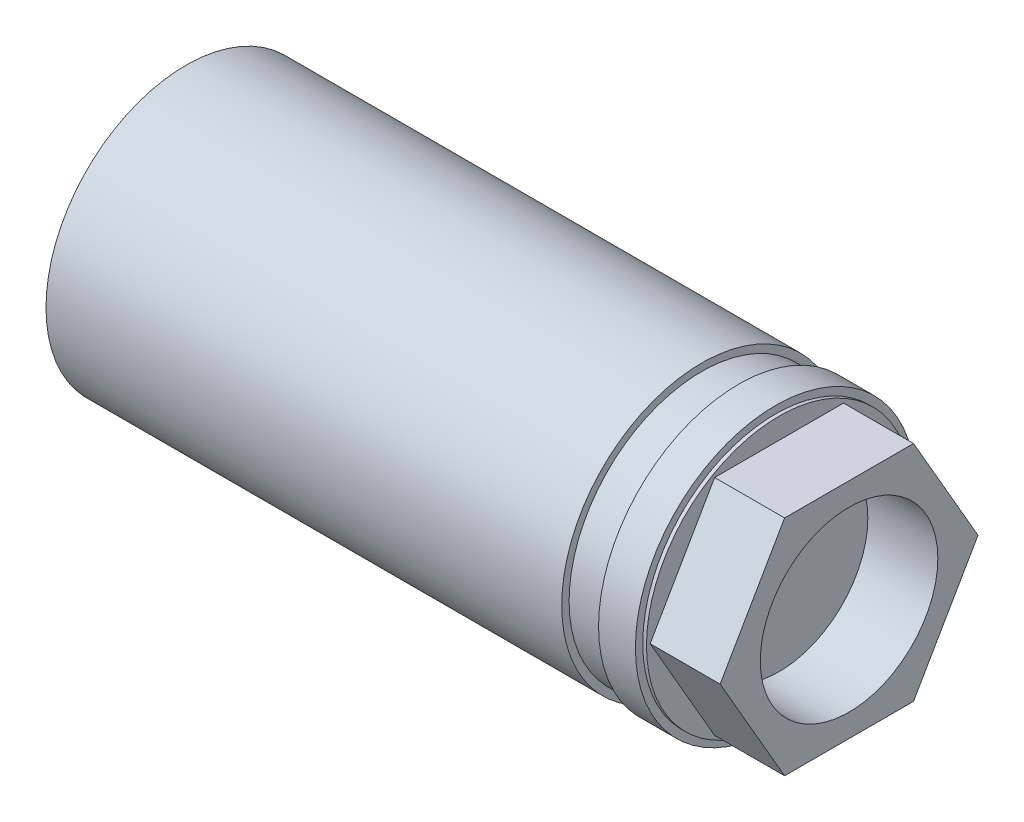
ISO-10303-21;
HEADER;
FILE_DESCRIPTION(('STEP AP214'),'2;1');
FILE_NAME('part.step','',(''),(''),'','','');
FILE_SCHEMA(('AUTOMOTIVE_DESIGN { 1 0 10303 214 1 1 1 1 }'));
ENDSEC;
DATA;
#1=APPLICATION_CONTEXT('core data for automotive mechanical design processes');
#2=APPLICATION_PROTOCOL_DEFINITION('international standard','automotive_design',2000,#1);
#3=PRODUCT_CONTEXT('',#1,'mechanical');
#4=PRODUCT('Part','Part','',(#3));
#5=PRODUCT_RELATED_PRODUCT_CATEGORY('part','',(#4));
#6=PRODUCT_DEFINITION_FORMATION('','',#4);
#7=PRODUCT_DEFINITION_CONTEXT('part definition',#1,'design');
#8=PRODUCT_DEFINITION('design','',#6,#7);
#9=PRODUCT_DEFINITION_SHAPE('','',#8);
#10=(LENGTH_UNIT() NAMED_UNIT(*) SI_UNIT(.MILLI.,.METRE.));
#11=(NAMED_UNIT(*) PLANE_ANGLE_UNIT() SI_UNIT($,.RADIAN.));
#12=(NAMED_UNIT(*) SI_UNIT($,.STERADIAN.) SOLID_ANGLE_UNIT());
#13=UNCERTAINTY_MEASURE_WITH_UNIT(LENGTH_MEASURE(1.E-05),#10,'distance_accuracy_value','');
#14=(GEOMETRIC_REPRESENTATION_CONTEXT(3) GLOBAL_UNCERTAINTY_ASSIGNED_CONTEXT((#13)) GLOBAL_UNIT_ASSIGNED_CONTEXT((#10,
#11,#12)) REPRESENTATION_CONTEXT('',''));
#15=CARTESIAN_POINT('',(0.,0.,0.));
#16=DIRECTION('',(0.,0.,1.));
#17=DIRECTION('',(1.,0.,0.));
#18=AXIS2_PLACEMENT_3D('',#15,#16,#17);
#19=CARTESIAN_POINT('',(80.5,18.,0.));
#20=DIRECTION('',(-1.,0.,0.));
#21=DIRECTION('',(0.,0.,1.));
#22=AXIS2_PLACEMENT_3D('',#19,#20,#21);
#23=PLANE('',#22);
#24=CARTESIAN_POINT('',(80.5,0.,0.));
#25=DIRECTION('',(-1.,0.,0.));
#26=DIRECTION('',(0.,0.,1.));
#27=AXIS2_PLACEMENT_3D('',#24,#25,#26);
#28=CIRCLE('',#27,18.);
#29=CARTESIAN_POINT('',(80.5,0.,18.));
#30=VERTEX_POINT('',#29);
#31=EDGE_CURVE('E106',#30,#30,#28,.T.);
#32=ORIENTED_EDGE('',*,*,#31,.F.);
#33=EDGE_LOOP('',(#32));
#34=FACE_BOUND('',#33,.T.);
#35=DIRECTION('',(0.,1.33887964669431E-05,0.99999999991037));
#36=VECTOR('',#35,1.);
#37=CARTESIAN_POINT('',(80.5,15.1553274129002,-8.7502029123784));
#38=LINE('',#37,#36);
#39=CARTESIAN_POINT('',(80.5,15.1553274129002,-8.7502029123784));
#40=VERTEX_POINT('',#39);
#41=CARTESIAN_POINT('',(80.5,15.1555617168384,8.74979708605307));
#42=VERTEX_POINT('',#41);
#43=EDGE_CURVE('E48',#40,#42,#38,.T.);
#44=ORIENTED_EDGE('',*,*,#43,.F.);
#45=DIRECTION('',(0.,0.86603209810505,0.499988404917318));
#46=VECTOR('',#45,1.);
#47=CARTESIAN_POINT('',(80.5,-0.000234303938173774,-17.4999999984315));
#48=LINE('',#47,#46);
#49=CARTESIAN_POINT('',(80.5,-0.000234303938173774,-17.4999999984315));
#50=VERTEX_POINT('',#49);
#51=EDGE_CURVE('E52',#50,#40,#48,.T.);
#52=ORIENTED_EDGE('',*,*,#51,.F.);
#53=DIRECTION('',(0.,0.866018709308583,-0.500011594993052));
#54=VECTOR('',#53,1.);
#55=CARTESIAN_POINT('',(80.5,-15.1555617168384,-8.74979708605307));
#56=LINE('',#55,#54);
#57=CARTESIAN_POINT('',(80.5,-15.1555617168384,-8.74979708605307));
#58=VERTEX_POINT('',#57);
#59=EDGE_CURVE('E339',#58,#50,#56,.T.);
#60=ORIENTED_EDGE('',*,*,#59,.F.);
#61=DIRECTION('',(0.,-1.33887964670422E-05,-0.99999999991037));
#62=VECTOR('',#61,1.);
#63=CARTESIAN_POINT('',(80.5,-15.1553274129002,8.7502029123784));
#64=LINE('',#63,#62);
#65=CARTESIAN_POINT('',(80.5,-15.1553274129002,8.7502029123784));
#66=VERTEX_POINT('',#65);
#67=EDGE_CURVE('E336',#66,#58,#64,.T.);
#68=ORIENTED_EDGE('',*,*,#67,.F.);
#69=DIRECTION('',(0.,-0.86603209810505,-0.499988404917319));
#70=VECTOR('',#69,1.);
#71=CARTESIAN_POINT('',(80.5,0.000234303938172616,17.4999999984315));
#72=LINE('',#71,#70);
#73=CARTESIAN_POINT('',(80.5,0.000234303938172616,17.4999999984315));
#74=VERTEX_POINT('',#73);
#75=EDGE_CURVE('E333',#74,#66,#72,.T.);
#76=ORIENTED_EDGE('',*,*,#75,.F.);
#77=DIRECTION('',(0.,-0.866018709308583,0.500011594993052));
#78=VECTOR('',#77,1.);
#79=CARTESIAN_POINT('',(80.5,15.1555617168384,8.74979708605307));
#80=LINE('',#79,#78);
#81=EDGE_CURVE('E320',#42,#74,#80,.T.);
#82=ORIENTED_EDGE('',*,*,#81,.F.);
#83=EDGE_LOOP('',(#44,#52,#60,#68,#76,#82));
#84=FACE_BOUND('',#83,.T.);
#85=ADVANCED_FACE('F33',(#34,#84),#23,.F.);
#86=CARTESIAN_POINT('',(0.,0.,0.));
#87=DIRECTION('',(1.,0.,0.));
#88=DIRECTION('',(0.,0.,-1.));
#89=AXIS2_PLACEMENT_3D('',#86,#87,#88);
#90=PLANE('',#89);
#91=CARTESIAN_POINT('',(0.,0.,0.));
#92=DIRECTION('',(-1.,0.,0.));
#93=DIRECTION('',(0.,0.,1.));
#94=AXIS2_PLACEMENT_3D('',#91,#92,#93);
#95=CIRCLE('',#94,19.);
#96=CARTESIAN_POINT('',(0.,0.,19.));
#97=VERTEX_POINT('',#96);
#98=EDGE_CURVE('E11',#97,#97,#95,.T.);
#99=ORIENTED_EDGE('',*,*,#98,.T.);
#100=EDGE_LOOP('',(#99));
#101=FACE_BOUND('',#100,.T.);
#102=ADVANCED_FACE('F35',(#101),#90,.F.);
#103=CARTESIAN_POINT('',(0.,0.,0.));
#104=DIRECTION('',(-1.,0.,0.));
#105=DIRECTION('',(0.,0.,1.));
#106=AXIS2_PLACEMENT_3D('',#103,#104,#105);
#107=CYLINDRICAL_SURFACE('',#106,19.);
#108=ORIENTED_EDGE('',*,*,#98,.F.);
#109=EDGE_LOOP('',(#108));
#110=FACE_BOUND('',#109,.T.);
#111=CARTESIAN_POINT('',(70.,0.,0.));
#112=DIRECTION('',(-1.,0.,0.));
#113=DIRECTION('',(0.,0.,1.));
#114=AXIS2_PLACEMENT_3D('',#111,#112,#113);
#115=CIRCLE('',#114,19.);
#116=CARTESIAN_POINT('',(70.,0.,19.));
#117=VERTEX_POINT('',#116);
#118=EDGE_CURVE('E41',#117,#117,#115,.T.);
#119=ORIENTED_EDGE('',*,*,#118,.T.);
#120=EDGE_LOOP('',(#119));
#121=FACE_BOUND('',#120,.T.);
#122=ADVANCED_FACE('F131',(#110,#121),#107,.T.);
#123=CARTESIAN_POINT('',(70.,19.,0.));
#124=DIRECTION('',(-1.,0.,0.));
#125=DIRECTION('',(0.,0.,1.));
#126=AXIS2_PLACEMENT_3D('',#123,#124,#125);
#127=PLANE('',#126);
#128=ORIENTED_EDGE('',*,*,#118,.F.);
#129=EDGE_LOOP('',(#128));
#130=FACE_BOUND('',#129,.T.);
#131=CARTESIAN_POINT('',(70.,0.,0.));
#132=DIRECTION('',(-1.,0.,0.));
#133=DIRECTION('',(0.,0.,1.));
#134=AXIS2_PLACEMENT_3D('',#131,#132,#133);
#135=CIRCLE('',#134,18.);
#136=CARTESIAN_POINT('',(70.,0.,18.));
#137=VERTEX_POINT('',#136);
#138=EDGE_CURVE('E126',#137,#137,#135,.T.);
#139=ORIENTED_EDGE('',*,*,#138,.T.);
#140=EDGE_LOOP('',(#139));
#141=FACE_BOUND('',#140,.T.);
#142=ADVANCED_FACE('F133',(#130,#141),#127,.F.);
#143=CARTESIAN_POINT('',(0.,0.,0.));
#144=DIRECTION('',(-1.,0.,0.));
#145=DIRECTION('',(0.,0.,1.));
#146=AXIS2_PLACEMENT_3D('',#143,#144,#145);
#147=CYLINDRICAL_SURFACE('',#146,18.);
#148=ORIENTED_EDGE('',*,*,#138,.F.);
#149=EDGE_LOOP('',(#148));
#150=FACE_BOUND('',#149,.T.);
#151=CARTESIAN_POINT('',(75.,0.,0.));
#152=DIRECTION('',(-1.,0.,0.));
#153=DIRECTION('',(0.,0.,1.));
#154=AXIS2_PLACEMENT_3D('',#151,#152,#153);
#155=CIRCLE('',#154,18.);
#156=CARTESIAN_POINT('',(75.,0.,18.));
#157=VERTEX_POINT('',#156);
#158=EDGE_CURVE('E123',#157,#157,#155,.T.);
#159=ORIENTED_EDGE('',*,*,#158,.T.);
#160=EDGE_LOOP('',(#159));
#161=FACE_BOUND('',#160,.T.);
#162=ADVANCED_FACE('F136',(#150,#161),#147,.T.);
#163=CARTESIAN_POINT('',(75.,18.,0.));
#164=DIRECTION('',(1.,0.,0.));
#165=DIRECTION('',(0.,0.,-1.));
#166=AXIS2_PLACEMENT_3D('',#163,#164,#165);
#167=PLANE('',#166);
#168=ORIENTED_EDGE('',*,*,#158,.F.);
#169=EDGE_LOOP('',(#168));
#170=FACE_BOUND('',#169,.T.);
#171=CARTESIAN_POINT('',(75.,0.,0.));
#172=DIRECTION('',(-1.,0.,0.));
#173=DIRECTION('',(0.,0.,1.));
#174=AXIS2_PLACEMENT_3D('',#171,#172,#173);
#175=CIRCLE('',#174,19.);
#176=CARTESIAN_POINT('',(75.,0.,19.));
#177=VERTEX_POINT('',#176);
#178=EDGE_CURVE('E120',#177,#177,#175,.T.);
#179=ORIENTED_EDGE('',*,*,#178,.T.);
#180=EDGE_LOOP('',(#179));
#181=FACE_BOUND('',#180,.T.);
#182=ADVANCED_FACE('F142',(#170,#181),#167,.F.);
#183=CARTESIAN_POINT('',(0.,0.,0.));
#184=DIRECTION('',(-1.,0.,0.));
#185=DIRECTION('',(0.,0.,1.));
#186=AXIS2_PLACEMENT_3D('',#183,#184,#185);
#187=CYLINDRICAL_SURFACE('',#186,19.);
#188=ORIENTED_EDGE('',*,*,#178,.F.);
#189=EDGE_LOOP('',(#188));
#190=FACE_BOUND('',#189,.T.);
#191=CARTESIAN_POINT('',(80.,0.,0.));
#192=DIRECTION('',(-1.,0.,0.));
#193=DIRECTION('',(0.,0.,1.));
#194=AXIS2_PLACEMENT_3D('',#191,#192,#193);
#195=CIRCLE('',#194,19.);
#196=CARTESIAN_POINT('',(80.,0.,19.));
#197=VERTEX_POINT('',#196);
#198=EDGE_CURVE('E117',#197,#197,#195,.T.);
#199=ORIENTED_EDGE('',*,*,#198,.T.);
#200=EDGE_LOOP('',(#199));
#201=FACE_BOUND('',#200,.T.);
#202=ADVANCED_FACE('F148',(#190,#201),#187,.T.);
#203=CARTESIAN_POINT('',(80.,19.,0.));
#204=DIRECTION('',(-1.,0.,0.));
#205=DIRECTION('',(0.,0.,1.));
#206=AXIS2_PLACEMENT_3D('',#203,#204,#205);
#207=PLANE('',#206);
#208=ORIENTED_EDGE('',*,*,#198,.F.);
#209=EDGE_LOOP('',(#208));
#210=FACE_BOUND('',#209,.T.);
#211=CARTESIAN_POINT('',(80.,0.,0.));
#212=DIRECTION('',(-1.,0.,0.));
#213=DIRECTION('',(0.,0.,1.));
#214=AXIS2_PLACEMENT_3D('',#211,#212,#213);
#215=CIRCLE('',#214,18.);
#216=CARTESIAN_POINT('',(80.,0.,18.));
#217=VERTEX_POINT('',#216);
#218=EDGE_CURVE('E109',#217,#217,#215,.T.);
#219=ORIENTED_EDGE('',*,*,#218,.T.);
#220=EDGE_LOOP('',(#219));
#221=FACE_BOUND('',#220,.T.);
#222=ADVANCED_FACE('F154',(#210,#221),#207,.F.);
#223=CARTESIAN_POINT('',(0.,0.,0.));
#224=DIRECTION('',(-1.,0.,0.));
#225=DIRECTION('',(0.,0.,1.));
#226=AXIS2_PLACEMENT_3D('',#223,#224,#225);
#227=CYLINDRICAL_SURFACE('',#226,18.);
#228=ORIENTED_EDGE('',*,*,#218,.F.);
#229=EDGE_LOOP('',(#228));
#230=FACE_BOUND('',#229,.T.);
#231=ORIENTED_EDGE('',*,*,#31,.T.);
#232=EDGE_LOOP('',(#231));
#233=FACE_BOUND('',#232,.T.);
#234=ADVANCED_FACE('F160',(#230,#233),#227,.T.);
#235=CARTESIAN_POINT('',(90.,15.1553274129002,-8.7502029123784));
#236=DIRECTION('',(0.,-0.99999999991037,1.33887964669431E-05));
#237=DIRECTION('',(0.,-1.33887964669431E-05,-0.99999999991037));
#238=AXIS2_PLACEMENT_3D('',#235,#236,#237);
#239=PLANE('',#238);
#240=ORIENTED_EDGE('',*,*,#43,.T.);
#241=DIRECTION('',(-1.,0.,0.));
#242=VECTOR('',#241,1.);
#243=CARTESIAN_POINT('',(90.,15.1555617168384,8.74979708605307));
#244=LINE('',#243,#242);
#245=CARTESIAN_POINT('',(90.,15.1555617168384,8.74979708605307));
#246=VERTEX_POINT('',#245);
#247=EDGE_CURVE('E89',#246,#42,#244,.T.);
#248=ORIENTED_EDGE('',*,*,#247,.F.);
#249=DIRECTION('',(0.,1.33887964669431E-05,0.99999999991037));
#250=VECTOR('',#249,1.);
#251=CARTESIAN_POINT('',(90.,15.1553274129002,-8.7502029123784));
#252=LINE('',#251,#250);
#253=CARTESIAN_POINT('',(90.,15.1553274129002,-8.7502029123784));
#254=VERTEX_POINT('',#253);
#255=EDGE_CURVE('E95',#254,#246,#252,.T.);
#256=ORIENTED_EDGE('',*,*,#255,.F.);
#257=DIRECTION('',(-1.,0.,0.));
#258=VECTOR('',#257,1.);
#259=CARTESIAN_POINT('',(90.,15.1553274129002,-8.7502029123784));
#260=LINE('',#259,#258);
#261=EDGE_CURVE('E330',#254,#40,#260,.T.);
#262=ORIENTED_EDGE('',*,*,#261,.T.);
#263=EDGE_LOOP('',(#240,#248,#256,#262));
#264=FACE_BOUND('',#263,.T.);
#265=ADVANCED_FACE('F105',(#264),#239,.F.);
#266=CARTESIAN_POINT('',(90.,15.1555617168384,8.74979708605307));
#267=DIRECTION('',(0.,-0.500011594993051,-0.866018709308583));
#268=DIRECTION('',(0.,0.866018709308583,-0.500011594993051));
#269=AXIS2_PLACEMENT_3D('',#266,#267,#268);
#270=PLANE('',#269);
#271=ORIENTED_EDGE('',*,*,#81,.T.);
#272=DIRECTION('',(-1.,0.,0.));
#273=VECTOR('',#272,1.);
#274=CARTESIAN_POINT('',(90.,0.000234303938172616,17.4999999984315));
#275=LINE('',#274,#273);
#276=CARTESIAN_POINT('',(90.,0.000234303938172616,17.4999999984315));
#277=VERTEX_POINT('',#276);
#278=EDGE_CURVE('E91',#277,#74,#275,.T.);
#279=ORIENTED_EDGE('',*,*,#278,.F.);
#280=DIRECTION('',(0.,-0.866018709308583,0.500011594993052));
#281=VECTOR('',#280,1.);
#282=CARTESIAN_POINT('',(90.,15.1555617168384,8.74979708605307));
#283=LINE('',#282,#281);
#284=EDGE_CURVE('E84',#246,#277,#283,.T.);
#285=ORIENTED_EDGE('',*,*,#284,.F.);
#286=ORIENTED_EDGE('',*,*,#247,.T.);
#287=EDGE_LOOP('',(#271,#279,#285,#286));
#288=FACE_BOUND('',#287,.T.);
#289=ADVANCED_FACE('F87',(#288),#270,.F.);
#290=CARTESIAN_POINT('',(90.,0.000234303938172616,17.4999999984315));
#291=DIRECTION('',(0.,0.499988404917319,-0.86603209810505));
#292=DIRECTION('',(0.,0.86603209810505,0.499988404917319));
#293=AXIS2_PLACEMENT_3D('',#290,#291,#292);
#294=PLANE('',#293);
#295=ORIENTED_EDGE('',*,*,#75,.T.);
#296=DIRECTION('',(-1.,0.,0.));
#297=VECTOR('',#296,1.);
#298=CARTESIAN_POINT('',(90.,-15.1553274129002,8.7502029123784));
#299=LINE('',#298,#297);
#300=CARTESIAN_POINT('',(90.,-15.1553274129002,8.7502029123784));
#301=VERTEX_POINT('',#300);
#302=EDGE_CURVE('E111',#301,#66,#299,.T.);
#303=ORIENTED_EDGE('',*,*,#302,.F.);
#304=DIRECTION('',(0.,-0.86603209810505,-0.499988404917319));
#305=VECTOR('',#304,1.);
#306=CARTESIAN_POINT('',(90.,0.000234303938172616,17.4999999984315));
#307=LINE('',#306,#305);
#308=EDGE_CURVE('E94',#277,#301,#307,.T.);
#309=ORIENTED_EDGE('',*,*,#308,.F.);
#310=ORIENTED_EDGE('',*,*,#278,.T.);
#311=EDGE_LOOP('',(#295,#303,#309,#310));
#312=FACE_BOUND('',#311,.T.);
#313=ADVANCED_FACE('F219',(#312),#294,.F.);
#314=CARTESIAN_POINT('',(90.,-15.1553274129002,8.7502029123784));
#315=DIRECTION('',(0.,0.99999999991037,-1.33887964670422E-05));
#316=DIRECTION('',(0.,1.33887964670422E-05,0.99999999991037));
#317=AXIS2_PLACEMENT_3D('',#314,#315,#316);
#318=PLANE('',#317);
#319=ORIENTED_EDGE('',*,*,#67,.T.);
#320=DIRECTION('',(-1.,0.,0.));
#321=VECTOR('',#320,1.);
#322=CARTESIAN_POINT('',(90.,-15.1555617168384,-8.74979708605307));
#323=LINE('',#322,#321);
#324=CARTESIAN_POINT('',(90.,-15.1555617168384,-8.74979708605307));
#325=VERTEX_POINT('',#324);
#326=EDGE_CURVE('E346',#325,#58,#323,.T.);
#327=ORIENTED_EDGE('',*,*,#326,.F.);
#328=DIRECTION('',(0.,-1.33887964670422E-05,-0.99999999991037));
#329=VECTOR('',#328,1.);
#330=CARTESIAN_POINT('',(90.,-15.1553274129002,8.7502029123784));
#331=LINE('',#330,#329);
#332=EDGE_CURVE('E326',#301,#325,#331,.T.);
#333=ORIENTED_EDGE('',*,*,#332,.F.);
#334=ORIENTED_EDGE('',*,*,#302,.T.);
#335=EDGE_LOOP('',(#319,#327,#333,#334));
#336=FACE_BOUND('',#335,.T.);
#337=ADVANCED_FACE('F225',(#336),#318,.F.);
#338=CARTESIAN_POINT('',(90.,-15.1555617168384,-8.74979708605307));
#339=DIRECTION('',(0.,0.500011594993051,0.866018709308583));
#340=DIRECTION('',(0.,-0.866018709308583,0.500011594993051));
#341=AXIS2_PLACEMENT_3D('',#338,#339,#340);
#342=PLANE('',#341);
#343=ORIENTED_EDGE('',*,*,#59,.T.);
#344=DIRECTION('',(-1.,0.,0.));
#345=VECTOR('',#344,1.);
#346=CARTESIAN_POINT('',(90.,-0.000234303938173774,-17.4999999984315));
#347=LINE('',#346,#345);
#348=CARTESIAN_POINT('',(90.,-0.000234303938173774,-17.4999999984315));
#349=VERTEX_POINT('',#348);
#350=EDGE_CURVE('E343',#349,#50,#347,.T.);
#351=ORIENTED_EDGE('',*,*,#350,.F.);
#352=DIRECTION('',(0.,0.866018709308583,-0.500011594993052));
#353=VECTOR('',#352,1.);
#354=CARTESIAN_POINT('',(90.,-15.1555617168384,-8.74979708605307));
#355=LINE('',#354,#353);
#356=EDGE_CURVE('E328',#325,#349,#355,.T.);
#357=ORIENTED_EDGE('',*,*,#356,.F.);
#358=ORIENTED_EDGE('',*,*,#326,.T.);
#359=EDGE_LOOP('',(#343,#351,#357,#358));
#360=FACE_BOUND('',#359,.T.);
#361=ADVANCED_FACE('F233',(#360),#342,.F.);
#362=CARTESIAN_POINT('',(90.,-0.000234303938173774,-17.4999999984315));
#363=DIRECTION('',(0.,-0.499988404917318,0.866032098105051));
#364=DIRECTION('',(0.,-0.866032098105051,-0.499988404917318));
#365=AXIS2_PLACEMENT_3D('',#362,#363,#364);
#366=PLANE('',#365);
#367=ORIENTED_EDGE('',*,*,#51,.T.);
#368=ORIENTED_EDGE('',*,*,#261,.F.);
#369=DIRECTION('',(0.,0.86603209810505,0.499988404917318));
#370=VECTOR('',#369,1.);
#371=CARTESIAN_POINT('',(90.,-0.000234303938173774,-17.4999999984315));
#372=LINE('',#371,#370);
#373=EDGE_CURVE('E100',#349,#254,#372,.T.);
#374=ORIENTED_EDGE('',*,*,#373,.F.);
#375=ORIENTED_EDGE('',*,*,#350,.T.);
#376=EDGE_LOOP('',(#367,#368,#374,#375));
#377=FACE_BOUND('',#376,.T.);
#378=ADVANCED_FACE('F241',(#377),#366,.F.);
#379=CARTESIAN_POINT('',(90.,0.,0.));
#380=DIRECTION('',(1.,0.,0.));
#381=DIRECTION('',(0.,0.,-1.));
#382=AXIS2_PLACEMENT_3D('',#379,#380,#381);
#383=PLANE('',#382);
#384=CARTESIAN_POINT('',(90.,0.,0.));
#385=DIRECTION('',(1.,0.,0.));
#386=DIRECTION('',(0.,0.,-1.));
#387=AXIS2_PLACEMENT_3D('',#384,#385,#386);
#388=CIRCLE('',#387,12.05);
#389=CARTESIAN_POINT('',(90.,0.,-12.05));
#390=VERTEX_POINT('',#389);
#391=EDGE_CURVE('E318',#390,#390,#388,.T.);
#392=ORIENTED_EDGE('',*,*,#391,.F.);
#393=EDGE_LOOP('',(#392));
#394=FACE_BOUND('',#393,.T.);
#395=ORIENTED_EDGE('',*,*,#255,.T.);
#396=ORIENTED_EDGE('',*,*,#284,.T.);
#397=ORIENTED_EDGE('',*,*,#308,.T.);
#398=ORIENTED_EDGE('',*,*,#332,.T.);
#399=ORIENTED_EDGE('',*,*,#356,.T.);
#400=ORIENTED_EDGE('',*,*,#373,.T.);
#401=EDGE_LOOP('',(#395,#396,#397,#398,#399,#400));
#402=FACE_BOUND('',#401,.T.);
#403=ADVANCED_FACE('F98',(#394,#402),#383,.T.);
#404=CARTESIAN_POINT('',(80.5,0.,0.));
#405=DIRECTION('',(1.,0.,0.));
#406=DIRECTION('',(0.,0.,-1.));
#407=AXIS2_PLACEMENT_3D('',#404,#405,#406);
#408=CYLINDRICAL_SURFACE('',#407,12.05);
#409=CARTESIAN_POINT('',(80.5,0.,0.));
#410=DIRECTION('',(1.,0.,0.));
#411=DIRECTION('',(0.,0.,-1.));
#412=AXIS2_PLACEMENT_3D('',#409,#410,#411);
#413=CIRCLE('',#412,12.05);
#414=CARTESIAN_POINT('',(80.5,0.,-12.05));
#415=VERTEX_POINT('',#414);
#416=EDGE_CURVE('E317',#415,#415,#413,.T.);
#417=ORIENTED_EDGE('',*,*,#416,.F.);
#418=EDGE_LOOP('',(#417));
#419=FACE_BOUND('',#418,.T.);
#420=ORIENTED_EDGE('',*,*,#391,.T.);
#421=EDGE_LOOP('',(#420));
#422=FACE_BOUND('',#421,.T.);
#423=ADVANCED_FACE('F256',(#419,#422),#408,.F.);
#424=CARTESIAN_POINT('',(80.5,0.,0.));
#425=DIRECTION('',(1.,0.,0.));
#426=DIRECTION('',(0.,0.,-1.));
#427=AXIS2_PLACEMENT_3D('',#424,#425,#426);
#428=PLANE('',#427);
#429=ORIENTED_EDGE('',*,*,#416,.T.);
#430=EDGE_LOOP('',(#429));
#431=FACE_BOUND('',#430,.T.);
#432=ADVANCED_FACE('F264',(#431),#428,.T.);
#433=CLOSED_SHELL('',(#85,#102,#122,#142,#162,#182,#202,#222,#234,#265,#289,#313,#337,#361,#378,
#403,#423,#432));
#434=MANIFOLD_SOLID_BREP('B2',#433);
#435=ADVANCED_BREP_SHAPE_REPRESENTATION('',(#18,#434),#14);
#436=SHAPE_DEFINITION_REPRESENTATION(#9,#435);
ENDSEC;
END-ISO-10303-21;
